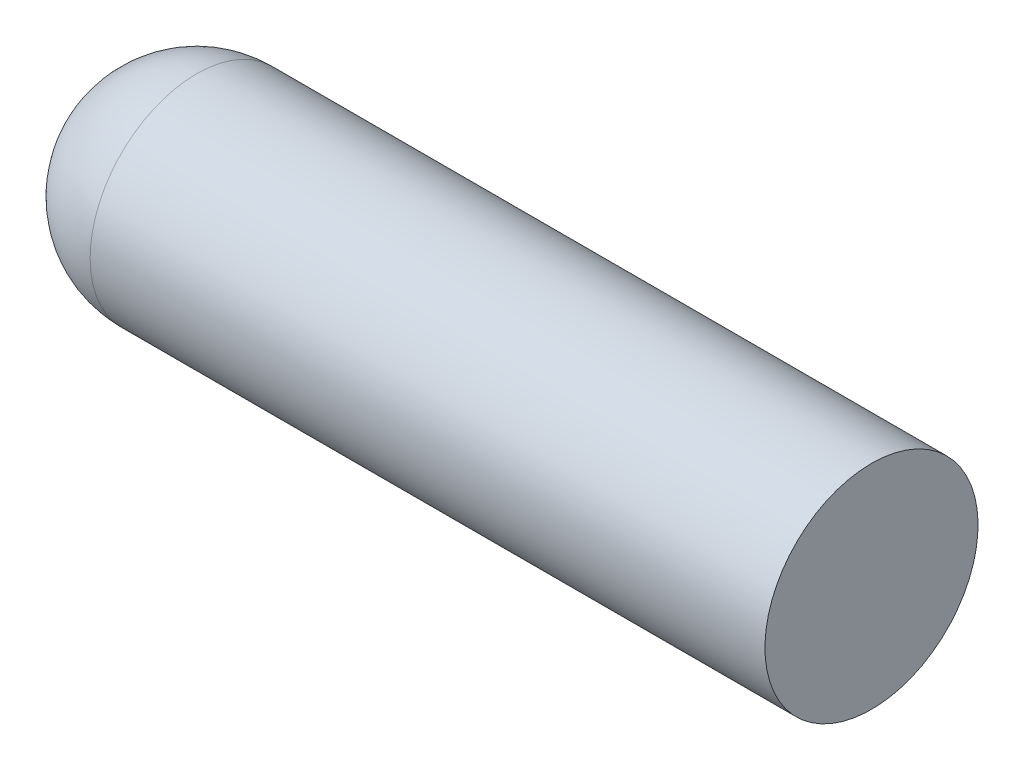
ISO-10303-21;
HEADER;
FILE_DESCRIPTION(('STEP AP214'),'2;1');
FILE_NAME('part.step','',(''),(''),'','','');
FILE_SCHEMA(('AUTOMOTIVE_DESIGN { 1 0 10303 214 1 1 1 1 }'));
ENDSEC;
DATA;
#1=APPLICATION_CONTEXT('core data for automotive mechanical design processes');
#2=APPLICATION_PROTOCOL_DEFINITION('international standard','automotive_design',2000,#1);
#3=PRODUCT_CONTEXT('',#1,'mechanical');
#4=PRODUCT('Part','Part','',(#3));
#5=PRODUCT_RELATED_PRODUCT_CATEGORY('part','',(#4));
#6=PRODUCT_DEFINITION_FORMATION('','',#4);
#7=PRODUCT_DEFINITION_CONTEXT('part definition',#1,'design');
#8=PRODUCT_DEFINITION('design','',#6,#7);
#9=PRODUCT_DEFINITION_SHAPE('','',#8);
#10=(LENGTH_UNIT() NAMED_UNIT(*) SI_UNIT(.MILLI.,.METRE.));
#11=(NAMED_UNIT(*) PLANE_ANGLE_UNIT() SI_UNIT($,.RADIAN.));
#12=(NAMED_UNIT(*) SI_UNIT($,.STERADIAN.) SOLID_ANGLE_UNIT());
#13=UNCERTAINTY_MEASURE_WITH_UNIT(LENGTH_MEASURE(1.E-05),#10,'distance_accuracy_value','');
#14=(GEOMETRIC_REPRESENTATION_CONTEXT(3) GLOBAL_UNCERTAINTY_ASSIGNED_CONTEXT((#13)) GLOBAL_UNIT_ASSIGNED_CONTEXT((#10,
#11,#12)) REPRESENTATION_CONTEXT('',''));
#15=CARTESIAN_POINT('',(0.,0.,0.));
#16=DIRECTION('',(0.,0.,1.));
#17=DIRECTION('',(1.,0.,0.));
#18=AXIS2_PLACEMENT_3D('',#15,#16,#17);
#19=CARTESIAN_POINT('',(-10.945,-29.85,0.));
#20=DIRECTION('',(1.,0.,0.));
#21=DIRECTION('',(0.,1.,0.));
#22=AXIS2_PLACEMENT_3D('',#19,#20,#21);
#23=CYLINDRICAL_SURFACE('',#22,1.4925);
#24=CARTESIAN_POINT('',(-9.4525,-29.85,0.));
#25=DIRECTION('',(1.,0.,0.));
#26=DIRECTION('',(0.,0.,1.));
#27=AXIS2_PLACEMENT_3D('',#24,#25,#26);
#28=CIRCLE('',#27,1.4925);
#29=CARTESIAN_POINT('',(-9.4525,-29.85,1.4925));
#30=VERTEX_POINT('',#29);
#31=EDGE_CURVE('E10',#30,#30,#28,.T.);
#32=ORIENTED_EDGE('',*,*,#31,.T.);
#33=EDGE_LOOP('',(#32));
#34=FACE_BOUND('',#33,.T.);
#35=CARTESIAN_POINT('',(0.,-29.85,0.));
#36=DIRECTION('',(1.,0.,0.));
#37=DIRECTION('',(0.,1.,0.));
#38=AXIS2_PLACEMENT_3D('',#35,#36,#37);
#39=CIRCLE('',#38,1.4925);
#40=CARTESIAN_POINT('',(0.,-28.3575,0.));
#41=VERTEX_POINT('',#40);
#42=EDGE_CURVE('E21',#41,#41,#39,.T.);
#43=ORIENTED_EDGE('',*,*,#42,.F.);
#44=EDGE_LOOP('',(#43));
#45=FACE_BOUND('',#44,.T.);
#46=ADVANCED_FACE('F14',(#34,#45),#23,.T.);
#47=CARTESIAN_POINT('',(0.,-29.85,0.));
#48=DIRECTION('',(1.,0.,0.));
#49=DIRECTION('',(0.,1.,0.));
#50=AXIS2_PLACEMENT_3D('',#47,#48,#49);
#51=PLANE('',#50);
#52=ORIENTED_EDGE('',*,*,#42,.T.);
#53=EDGE_LOOP('',(#52));
#54=FACE_BOUND('',#53,.T.);
#55=ADVANCED_FACE('F46',(#54),#51,.T.);
#56=CARTESIAN_POINT('',(-9.4525,-29.85,0.));
#57=DIRECTION('',(0.,0.,1.));
#58=DIRECTION('',(-1.,0.,0.));
#59=AXIS2_PLACEMENT_3D('',#56,#57,#58);
#60=SPHERICAL_SURFACE('',#59,1.4925);
#61=CARTESIAN_POINT('',(-9.4525,-29.85,0.));
#62=DIRECTION('',(1.,0.,0.));
#63=DIRECTION('',(0.,0.,1.));
#64=AXIS2_PLACEMENT_3D('',#61,#62,#63);
#65=SPHERICAL_SURFACE('',#64,1.4925);
#66=ORIENTED_EDGE('',*,*,#31,.F.);
#67=EDGE_LOOP('',(#66));
#68=FACE_BOUND('',#67,.T.);
#69=ADVANCED_FACE('F54',(#68),#65,.T.);
#70=CLOSED_SHELL('',(#46,#55,#69));
#71=MANIFOLD_SOLID_BREP('B1',#70);
#72=ADVANCED_BREP_SHAPE_REPRESENTATION('',(#18,#71),#14);
#73=SHAPE_DEFINITION_REPRESENTATION(#9,#72);
ENDSEC;
END-ISO-10303-21;
